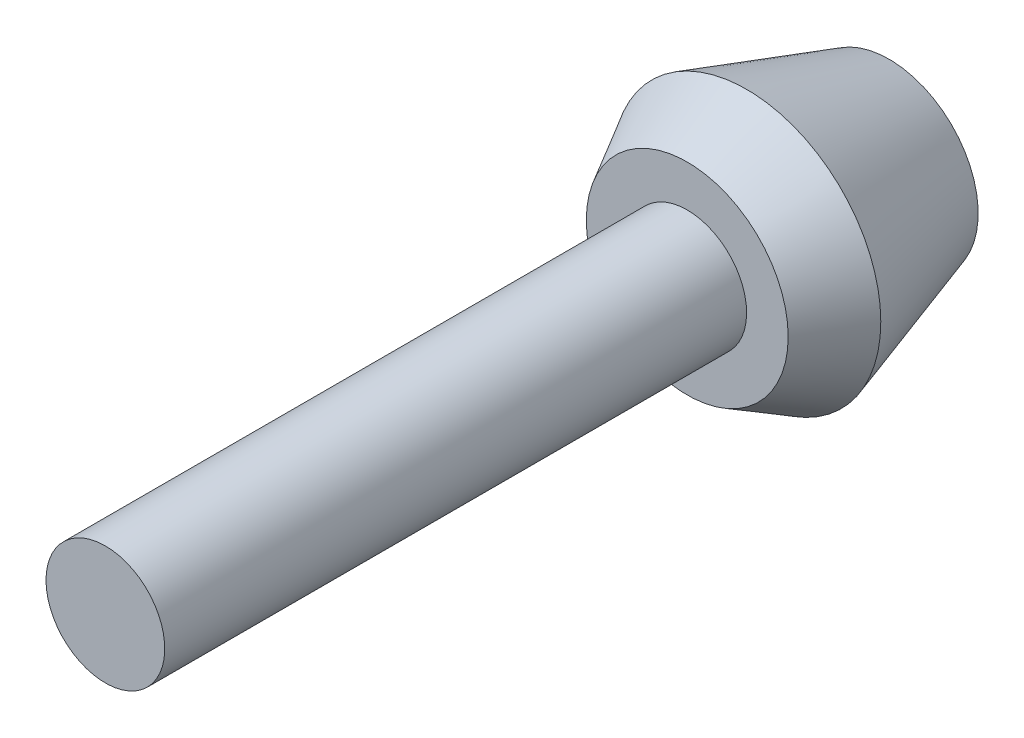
ISO-10303-21;
HEADER;
FILE_DESCRIPTION(('STEP AP214'),'2;1');
FILE_NAME('part.step','',(''),(''),'','','');
FILE_SCHEMA(('AUTOMOTIVE_DESIGN { 1 0 10303 214 1 1 1 1 }'));
ENDSEC;
DATA;
#1=APPLICATION_CONTEXT('core data for automotive mechanical design processes');
#2=APPLICATION_PROTOCOL_DEFINITION('international standard','automotive_design',2000,#1);
#3=PRODUCT_CONTEXT('',#1,'mechanical');
#4=PRODUCT('Part','Part','',(#3));
#5=PRODUCT_RELATED_PRODUCT_CATEGORY('part','',(#4));
#6=PRODUCT_DEFINITION_FORMATION('','',#4);
#7=PRODUCT_DEFINITION_CONTEXT('part definition',#1,'design');
#8=PRODUCT_DEFINITION('design','',#6,#7);
#9=PRODUCT_DEFINITION_SHAPE('','',#8);
#10=(LENGTH_UNIT() NAMED_UNIT(*) SI_UNIT(.MILLI.,.METRE.));
#11=(NAMED_UNIT(*) PLANE_ANGLE_UNIT() SI_UNIT($,.RADIAN.));
#12=(NAMED_UNIT(*) SI_UNIT($,.STERADIAN.) SOLID_ANGLE_UNIT());
#13=UNCERTAINTY_MEASURE_WITH_UNIT(LENGTH_MEASURE(1.E-05),#10,'distance_accuracy_value','');
#14=(GEOMETRIC_REPRESENTATION_CONTEXT(3) GLOBAL_UNCERTAINTY_ASSIGNED_CONTEXT((#13)) GLOBAL_UNIT_ASSIGNED_CONTEXT((#10,
#11,#12)) REPRESENTATION_CONTEXT('',''));
#15=CARTESIAN_POINT('',(0.,0.,0.));
#16=DIRECTION('',(0.,0.,1.));
#17=DIRECTION('',(1.,0.,0.));
#18=AXIS2_PLACEMENT_3D('',#15,#16,#17);
#19=CARTESIAN_POINT('',(0.,0.,0.));
#20=DIRECTION('',(0.,0.,-1.));
#21=DIRECTION('',(0.769107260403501,-0.639119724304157,0.));
#22=AXIS2_PLACEMENT_3D('',#19,#20,#21);
#23=PLANE('',#22);
#24=CARTESIAN_POINT('',(0.,0.,0.));
#25=DIRECTION('',(0.,0.,-1.));
#26=DIRECTION('',(-1.,0.,0.));
#27=AXIS2_PLACEMENT_3D('',#24,#25,#26);
#28=CIRCLE('',#27,3.75000000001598);
#29=CARTESIAN_POINT('',(-3.75000000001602,0.,0.));
#30=VERTEX_POINT('',#29);
#31=EDGE_CURVE('E33',#30,#30,#28,.F.);
#32=ORIENTED_EDGE('',*,*,#31,.F.);
#33=EDGE_LOOP('',(#32));
#34=FACE_BOUND('',#33,.T.);
#35=ADVANCED_FACE('F15',(#34),#23,.T.);
#36=CARTESIAN_POINT('',(0.,0.,5.79362678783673));
#37=DIRECTION('',(0.,0.,1.));
#38=DIRECTION('',(-0.769107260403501,0.639119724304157,0.));
#39=AXIS2_PLACEMENT_3D('',#36,#37,#38);
#40=CONICAL_SURFACE('',#39,5.58464848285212,0.306676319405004);
#41=ORIENTED_EDGE('',*,*,#31,.T.);
#42=EDGE_LOOP('',(#41));
#43=FACE_BOUND('',#42,.T.);
#44=CARTESIAN_POINT('',(0.,0.,5.99999999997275));
#45=DIRECTION('',(0.,0.,-1.));
#46=DIRECTION('',(-1.,0.,0.));
#47=AXIS2_PLACEMENT_3D('',#44,#45,#46);
#48=CIRCLE('',#47,5.65000000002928);
#49=CARTESIAN_POINT('',(-5.65000000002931,0.,5.99999999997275));
#50=VERTEX_POINT('',#49);
#51=EDGE_CURVE('E22',#50,#50,#48,.T.);
#52=ORIENTED_EDGE('',*,*,#51,.T.);
#53=EDGE_LOOP('',(#52));
#54=FACE_BOUND('',#53,.T.);
#55=ADVANCED_FACE('F54',(#43,#54),#40,.T.);
#56=CARTESIAN_POINT('',(0.,0.,6.18887432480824));
#57=DIRECTION('',(0.,0.,-1.));
#58=DIRECTION('',(0.769107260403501,-0.639119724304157,0.));
#59=AXIS2_PLACEMENT_3D('',#56,#57,#58);
#60=CONICAL_SURFACE('',#59,5.54423037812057,0.510488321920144);
#61=CARTESIAN_POINT('',(0.,0.,8.5));
#62=DIRECTION('',(0.,0.,-1.));
#63=DIRECTION('',(-1.,0.,0.));
#64=AXIS2_PLACEMENT_3D('',#61,#62,#63);
#65=CIRCLE('',#64,4.25000000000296);
#66=CARTESIAN_POINT('',(-4.25000000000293,0.,8.5));
#67=VERTEX_POINT('',#66);
#68=EDGE_CURVE('E10',#67,#67,#65,.F.);
#69=ORIENTED_EDGE('',*,*,#68,.F.);
#70=EDGE_LOOP('',(#69));
#71=FACE_BOUND('',#70,.T.);
#72=ORIENTED_EDGE('',*,*,#51,.F.);
#73=EDGE_LOOP('',(#72));
#74=FACE_BOUND('',#73,.T.);
#75=ADVANCED_FACE('F17',(#71,#74),#60,.T.);
#76=CARTESIAN_POINT('',(0.,0.,33.));
#77=DIRECTION('',(0.,0.,-1.));
#78=DIRECTION('',(0.692363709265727,-0.721548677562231,0.));
#79=AXIS2_PLACEMENT_3D('',#76,#77,#78);
#80=PLANE('',#79);
#81=CARTESIAN_POINT('',(0.,0.,33.));
#82=DIRECTION('',(0.,0.,-1.));
#83=DIRECTION('',(-1.,0.,0.));
#84=AXIS2_PLACEMENT_3D('',#81,#82,#83);
#85=CIRCLE('',#84,2.5);
#86=CARTESIAN_POINT('',(-2.50000000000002,0.,33.));
#87=VERTEX_POINT('',#86);
#88=EDGE_CURVE('E26',#87,#87,#85,.T.);
#89=ORIENTED_EDGE('',*,*,#88,.F.);
#90=EDGE_LOOP('',(#89));
#91=FACE_BOUND('',#90,.T.);
#92=ADVANCED_FACE('F50',(#91),#80,.F.);
#93=CARTESIAN_POINT('',(0.,0.,2.));
#94=DIRECTION('',(0.,0.,1.));
#95=DIRECTION('',(-0.692363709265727,0.721548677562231,0.));
#96=AXIS2_PLACEMENT_3D('',#93,#94,#95);
#97=CYLINDRICAL_SURFACE('',#96,2.5);
#98=CARTESIAN_POINT('',(0.,0.,8.5));
#99=DIRECTION('',(0.,0.,1.));
#100=DIRECTION('',(-0.769107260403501,0.639119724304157,0.));
#101=AXIS2_PLACEMENT_3D('',#98,#99,#100);
#102=CIRCLE('',#101,2.5);
#103=CARTESIAN_POINT('',(-1.92276815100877,1.5977993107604,8.5));
#104=VERTEX_POINT('',#103);
#105=EDGE_CURVE('E30',#104,#104,#102,.T.);
#106=ORIENTED_EDGE('',*,*,#105,.T.);
#107=EDGE_LOOP('',(#106));
#108=FACE_BOUND('',#107,.T.);
#109=ORIENTED_EDGE('',*,*,#88,.T.);
#110=EDGE_LOOP('',(#109));
#111=FACE_BOUND('',#110,.T.);
#112=ADVANCED_FACE('F39',(#108,#111),#97,.T.);
#113=CARTESIAN_POINT('',(6.06615460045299,7.29992107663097,8.5));
#114=DIRECTION('',(0.,0.,-1.));
#115=DIRECTION('',(0.769107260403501,-0.639119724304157,0.));
#116=AXIS2_PLACEMENT_3D('',#113,#114,#115);
#117=PLANE('',#116);
#118=ORIENTED_EDGE('',*,*,#105,.F.);
#119=EDGE_LOOP('',(#118));
#120=FACE_BOUND('',#119,.T.);
#121=ORIENTED_EDGE('',*,*,#68,.T.);
#122=EDGE_LOOP('',(#121));
#123=FACE_BOUND('',#122,.T.);
#124=ADVANCED_FACE('F42',(#120,#123),#117,.F.);
#125=CLOSED_SHELL('',(#35,#55,#75,#92,#112,#124));
#126=MANIFOLD_SOLID_BREP('B1',#125);
#127=ADVANCED_BREP_SHAPE_REPRESENTATION('',(#18,#126),#14);
#128=SHAPE_DEFINITION_REPRESENTATION(#9,#127);
ENDSEC;
END-ISO-10303-21;
